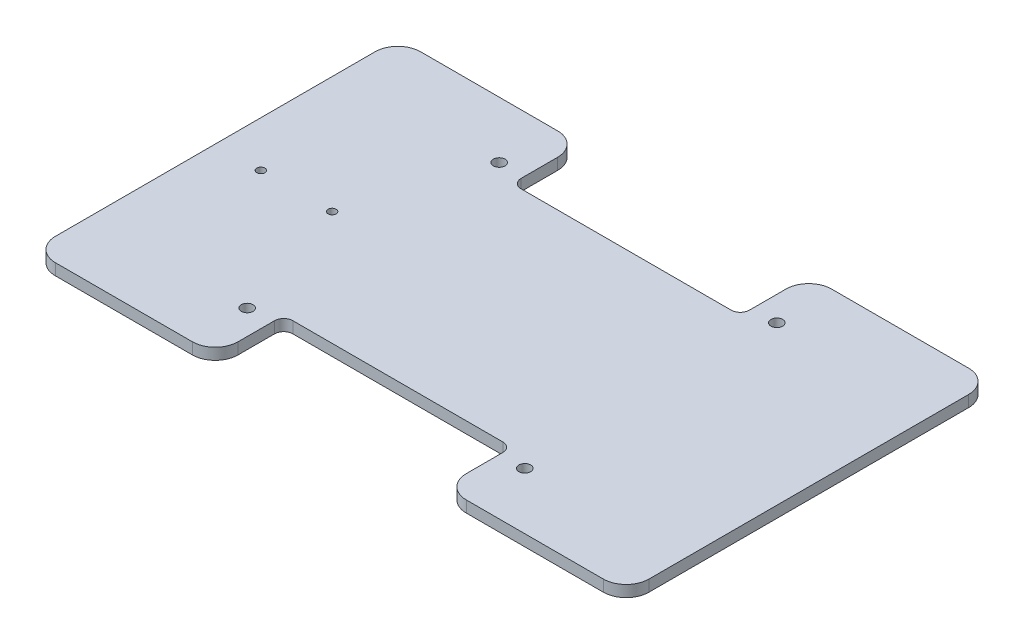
from build123d import *

# Parameters (mm, degrees)
SKETCH1_W             = 165.1
SKETCH1_H             = 101.6
BOSS_EXTRUDE1_DEPTH   = 3.175
FILLET1_R             = 6.35
F_4_CLEARANCE_HOLE1_D = 3.2639
CUT_EXTRUDE1_DEPTH    = 97.980529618
F_4_40_TAPPED_HOLE1_D = 2.2606


with BuildPart() as part:
    # Sketch1 → Boss-Extrude1 (new body)
    with BuildSketch(Plane(origin=(0, 0, 0), x_dir=(1, 0, 0), z_dir=(0, 1, 0))):
        Rectangle(SKETCH1_W, SKETCH1_H)
    extrude(amount=BOSS_EXTRUDE1_DEPTH)

    # Fillet1
    fillet1_edges = [part.edges().sort_by_distance(p)[0] for p in [
        (82.55, 1.5875, 50.8),
        (-82.55, 1.5875, 50.8),
        (-82.55, 1.5875, -50.8),
        (82.55, 1.5875, -50.8),
    ]]
    fillet(fillet1_edges, radius=FILLET1_R)

    # 4 Clearance Hole1 (through all)
    with Locations(Plane(origin=(0, 3.175, 0), x_dir=(1, 0, 0), z_dir=(0, 1, 0))):
        with Locations((-38.608, 35.052), (38.608, 35.052), (38.608, -35.052), (-38.608, -35.052)):
            Hole(F_4_CLEARANCE_HOLE1_D / 2)

    # Sketch5 → Cut-Extrude1 (cut, through all)
    with BuildSketch(Plane(origin=(0, 3.175, 0), x_dir=(1, 0, 0), z_dir=(0, 1, 0))):
        with BuildLine():
            Line((-31.75, 34.29), (-31.75, 44.45))
            ThreePointArc((-31.75, 44.45), (-33.609871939, 48.940128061), (-38.1, 50.8))
            Line((-38.1, 50.8), (38.1, 50.8))
            ThreePointArc((38.1, 50.8), (33.609871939, 48.940128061), (31.75, 44.45))
            Line((31.75, 44.45), (31.75, 34.29))
            ThreePointArc((31.75, 34.29), (31.006051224, 32.493948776), (29.21, 31.75))
            Line((29.21, 31.75), (-29.21, 31.75))
            ThreePointArc((-29.21, 31.75), (-31.006051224, 32.493948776), (-31.75, 34.29))
        make_face()
        with BuildLine():
            Line((-31.75, -34.29), (-31.75, -44.45))
            ThreePointArc((-31.75, -44.45), (-33.609871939, -48.940128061), (-38.1, -50.8))
            Line((-38.1, -50.8), (38.1, -50.8))
            ThreePointArc((38.1, -50.8), (33.609871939, -48.940128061), (31.75, -44.45))
            Line((31.75, -44.45), (31.75, -34.29))
            ThreePointArc((31.75, -34.29), (31.006051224, -32.493948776), (29.21, -31.75))
            Line((29.21, -31.75), (-29.21, -31.75))
            ThreePointArc((-29.21, -31.75), (-31.006051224, -32.493948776), (-31.75, -34.29))
        make_face()
    extrude(amount=-CUT_EXTRUDE1_DEPTH, mode=Mode.SUBTRACT)

    # 4-40 Tapped Hole1 (through all)
    with Locations(Plane(origin=(0, 3.175, 0), x_dir=(1, 0, 0), z_dir=(0, 1, 0))):
        with Locations((-69.85, 0), (-50.038, 0)):
            Hole(F_4_40_TAPPED_HOLE1_D / 2)


solid = part.part
